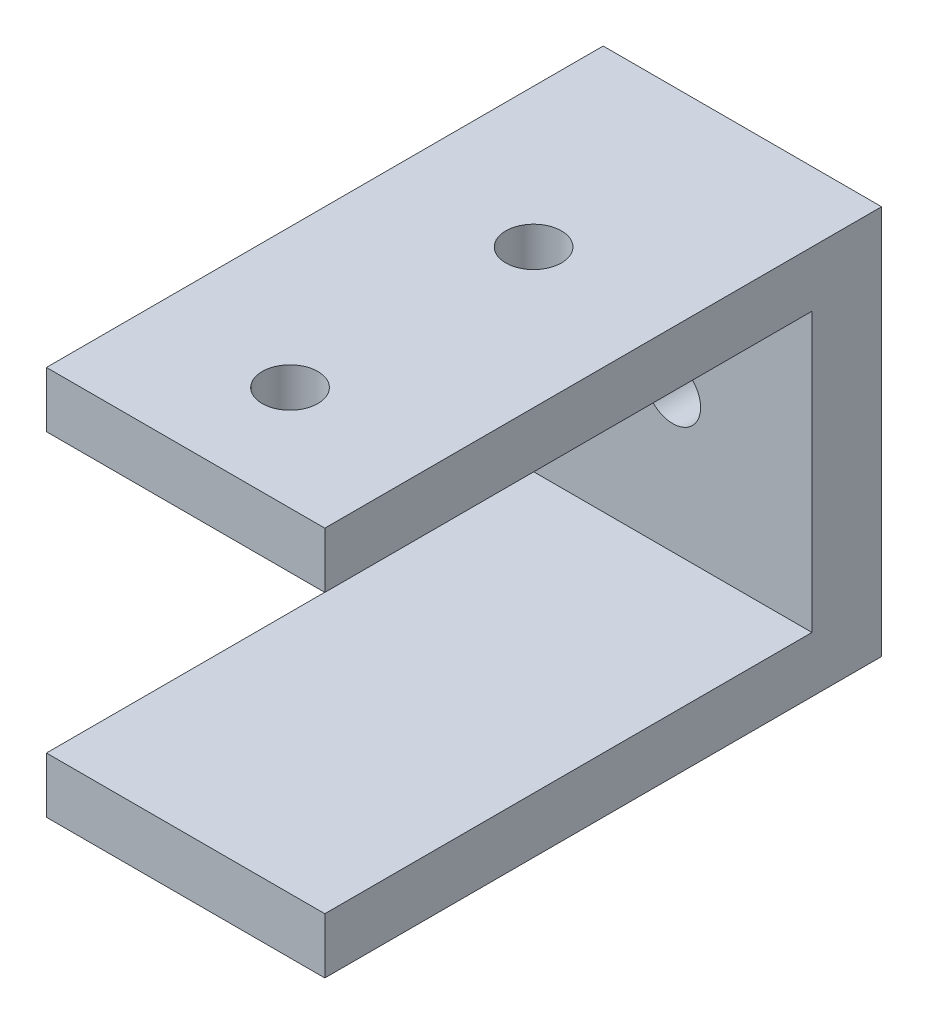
from build123d import *

# Parameters (mm, degrees)
BOSS_EXTRUDE3_DEPTH = 20
SKETCH14_R          = 2
CUT_EXTRUDE5_DEPTH  = 10
SKETCH13_R          = 2
CUT_EXTRUDE6_DEPTH  = 10


with BuildPart() as part:
    # Sketch7 → Boss-Extrude3 (new body)
    with BuildSketch(Plane(origin=(0, 0, 0), x_dir=(0, 0, -1), z_dir=(1, 0, 0))):
        Polygon((-25, 19.99), (-5, 19.99), (-5, 0), (-25, 0), (-40, 0), (-40, -4), (-25, -4), (0, -4), (0, 23.99), (-25, 23.99), (-40, 23.99), (-40, 19.99), align=None)
    extrude(amount=BOSS_EXTRUDE3_DEPTH)

    # Sketch14 → Cut-Extrude5 (cut)
    with BuildSketch(Plane(origin=(0, 0, 0), x_dir=(-1, 0, 0), z_dir=(0, 0, -1))):
        with Locations(Location((-10, 9.995, 0), (0, 0, 90))):
            Circle(SKETCH14_R)
    extrude(amount=-CUT_EXTRUDE5_DEPTH, mode=Mode.SUBTRACT)

    # Sketch13 → Cut-Extrude6 (cut)
    with BuildSketch(Plane(origin=(0, 23.99, 0), x_dir=(1, 0, 0), z_dir=(0, 1, 0))):
        with Locations(Location((10, -15, 0), (0, 0, 270))):
            Circle(SKETCH13_R)
        with Locations(Location((10, -32.5, 0), (0, 0, 270))):
            Circle(SKETCH13_R)
    extrude(amount=-CUT_EXTRUDE6_DEPTH, mode=Mode.SUBTRACT)


solid = part.part
